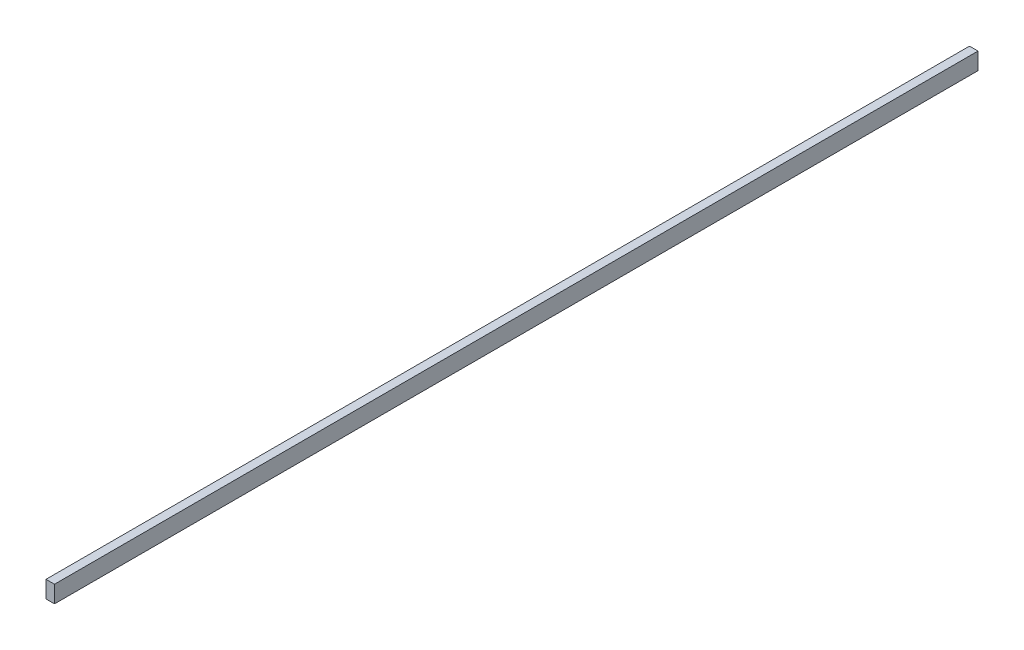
from build123d import *

# Parameters (mm, degrees)
ESQUISSE1_W      = 5
ESQUISSE1_H      = 10
EXTRUSION1_DEPTH = 542.31


with BuildPart() as part:
    # Esquisse1 → Extrusion1 (new body)
    with BuildSketch(Plane.XY):
        with Locations((2.5, 5)):
            Rectangle(ESQUISSE1_W, ESQUISSE1_H)
    extrude(amount=EXTRUSION1_DEPTH)


solid = part.part
